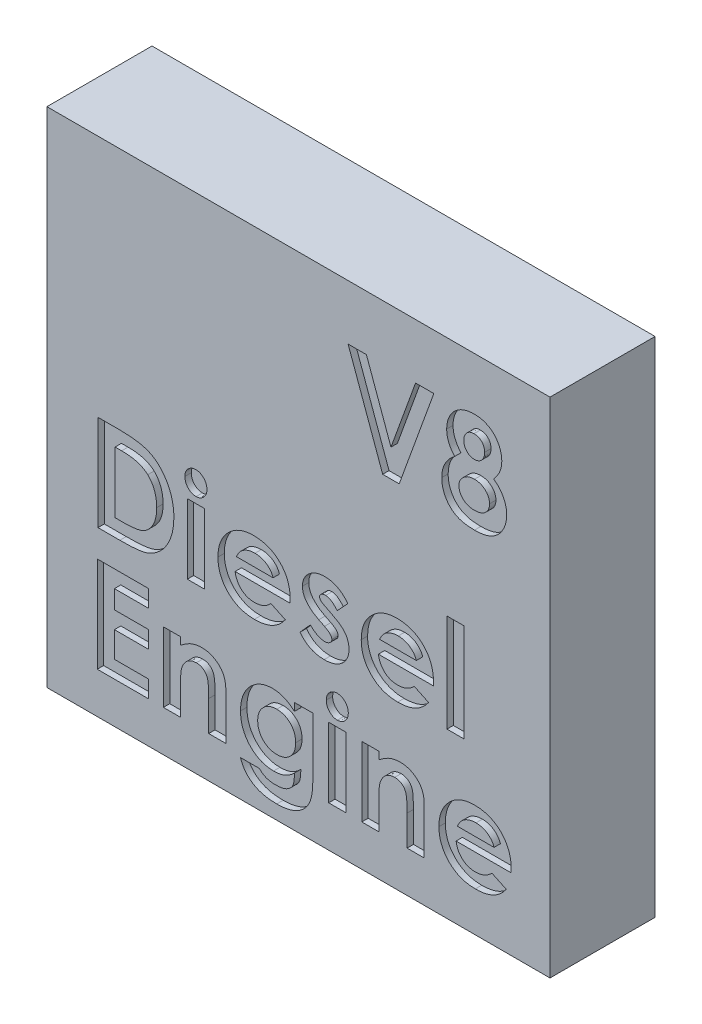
from build123d import *

# Parameters (mm, degrees)
SKETCH_1_W          = 15.8
SKETCH_1_H          = 15.8
EXTRUDE_286_DEPTH   = 3.3
SKETCH_3_W          = 12.8
SKETCH_3_H          = 12.8
CUT_EXTRUDE_1_DEPTH = 2
SKETCH_4_R          = 3.25
SKETCH_4_R_2        = 2.5
EXTRUDE_2_DEPTH     = 2
CUT_EXTRUDE1_DEPTH  = 0.2
SKETCH2_W           = 0.538461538
SKETCH2_H           = 2.192307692
CUT_EXTRUDE2_DEPTH  = 0.2
SKETCH3_W           = 0.538461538
SKETCH3_H           = 2.192307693
SKETCH3_H_2         = 3.076923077
CUT_EXTRUDE3_DEPTH  = 0.2


with BuildPart() as part:
    # Sketch 1 → Extrude 286 (new body)
    with BuildSketch(Plane(origin=(0.007312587, -0.1312965, 0), x_dir=(1, 0, 0), z_dir=(0, 0, 1))):
        with Locations((-0.684916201, 0.099581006)):
            Rectangle(SKETCH_1_W, SKETCH_1_H)
    extrude(amount=-EXTRUDE_286_DEPTH)

    # Sketch 3 → Cut-Extrude 1 (cut)
    with BuildSketch(Plane(origin=(0, 0, -3.3), x_dir=(-1, 0, 0), z_dir=(0, 0, -1))):
        with Locations((0.677603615, -0.031715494)):
            Rectangle(SKETCH_3_W, SKETCH_3_H)
    extrude(amount=-CUT_EXTRUDE_1_DEPTH, mode=Mode.SUBTRACT)

    # Sketch 4 → Extrude 2 (add)
    with BuildSketch(Plane(origin=(0, 0, -1.3), x_dir=(-1, 0, 0), z_dir=(0, 0, -1))):
        with Locations((0.577603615, 0.068284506)):
            Circle(SKETCH_4_R)
        with Locations((0.577603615, 0.068284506)):
            Circle(SKETCH_4_R_2, mode=Mode.SUBTRACT)
    extrude(amount=EXTRUDE_2_DEPTH)

    # Sketch1 → Cut-Extrude1 (cut)
    # profile 1 of 2: a face of its own
    with BuildSketch(Plane.XY):
        Polygon((0.881378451, 6.140898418), (1.456498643, 6.140898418), (2.227532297, 4.009888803), (3.000368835, 6.140898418), (3.573686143, 6.140898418), (2.485945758, 3.140898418), (1.967315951, 3.140898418), align=None)
    # profile 2 of 2: a face of its own
    with BuildSketch(Plane.XY):
        with BuildLine():
            add(Edge.make_bspline(
                [(5.451089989, 4.756283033), (5.482548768, 4.733804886), (5.544818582, 4.689311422), (5.627054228, 4.609599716), (5.697887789, 4.520680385), (5.756575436, 4.42309884), (5.803594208, 4.319253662), (5.837252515, 4.210254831), (5.858631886, 4.097063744), (5.860967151, 4.020000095), (5.862147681, 3.981042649)],
                knots=[0, 0, 0, 0, 1.013736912, 2.006600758, 2.994453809, 3.989973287, 4.987781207, 5.978959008, 6.978317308, 8, 8, 8, 8], degree=3))
            add(Edge.make_bspline(
                [(5.862147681, 3.981042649), (5.860723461, 3.938858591), (5.857898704, 3.855191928), (5.832924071, 3.732494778), (5.792828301, 3.614618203), (5.738029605, 3.502863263), (5.66932212, 3.400702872), (5.589237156, 3.310261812), (5.49767376, 3.233902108), (5.412425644, 3.182092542), (5.339049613, 3.147676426), (5.279835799, 3.125650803), (5.217309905, 3.106260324), (5.151025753, 3.090768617), (5.080995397, 3.078674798), (5.007318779, 3.070688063), (4.929947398, 3.064882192), (4.877183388, 3.064282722), (4.850128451, 3.063975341)],
                knots=[0, 0, 0, 0, 1.313679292, 2.605514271, 3.884962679, 5.186178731, 6.472827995, 7.711026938, 8.938935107, 10.174644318, 10.808706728, 11.462743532, 12.142127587, 12.847854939, 13.582806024, 14.355735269, 15.156897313, 16, 16, 16, 16], degree=3))
            add(Edge.make_bspline(
                [(4.850128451, 3.063975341), (4.821277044, 3.064366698), (4.764935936, 3.065130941), (4.682690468, 3.069751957), (4.605108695, 3.07827132), (4.532027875, 3.089486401), (4.463518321, 3.104327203), (4.399578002, 3.123144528), (4.340052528, 3.144570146), (4.267190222, 3.177192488), (4.183921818, 3.228139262), (4.093923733, 3.302749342), (4.014928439, 3.391612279), (3.946249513, 3.492233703), (3.892114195, 3.603994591), (3.851857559, 3.723387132), (3.828017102, 3.850087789), (3.825146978, 3.93687151), (3.823686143, 3.981042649)],
                knots=[0, 0, 0, 0, 0.886964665, 1.7320671, 2.531131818, 3.285397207, 4.004107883, 4.684213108, 5.332925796, 5.947568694, 7.135706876, 8.320776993, 9.52873045, 10.778999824, 12.05415135, 13.333578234, 14.642845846, 16, 16, 16, 16], degree=3))
            add(Edge.make_bspline(
                [(3.823686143, 3.981042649), (3.825021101, 4.019574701), (3.827644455, 4.09529485), (3.846435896, 4.206248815), (3.878657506, 4.311446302), (3.92287057, 4.411619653), (3.979882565, 4.506780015), (4.050030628, 4.596227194), (4.132425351, 4.680768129), (4.194906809, 4.730693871), (4.226931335, 4.756283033)],
                knots=[0, 0, 0, 0, 1.01821053, 2.000906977, 2.963938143, 3.919209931, 4.888045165, 5.887808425, 6.917407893, 8, 8, 8, 8], degree=3))
            add(Edge.make_bspline(
                [(4.226931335, 4.756283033), (4.207077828, 4.77918115), (4.167992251, 4.824260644), (4.11741513, 4.896812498), (4.074806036, 4.971613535), (4.038628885, 5.048056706), (4.011885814, 5.127458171), (3.991661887, 5.208569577), (3.980223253, 5.292217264), (3.97843536, 5.34859829), (3.977532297, 5.377076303)],
                knots=[0, 0, 0, 0, 1.061529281, 2.089831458, 3.092927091, 4.075998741, 5.048384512, 6.024008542, 7.00192825, 8, 8, 8, 8], degree=3))
            add(Edge.make_bspline(
                [(3.977532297, 5.377076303), (3.978729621, 5.415627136), (3.981091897, 5.491686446), (4.002014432, 5.602903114), (4.036750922, 5.708581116), (4.08400696, 5.808411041), (4.144014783, 5.900217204), (4.215317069, 5.982546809), (4.298916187, 6.052384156), (4.391703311, 6.112307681), (4.494143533, 6.159970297), (4.605264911, 6.193321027), (4.723725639, 6.214433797), (4.805365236, 6.216675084), (4.847123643, 6.217821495)],
                knots=[0, 0, 0, 0, 1.022455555, 2.017265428, 2.990720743, 3.968117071, 4.939886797, 5.893155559, 6.847550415, 7.820889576, 8.817530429, 9.83499769, 10.892607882, 12, 12, 12, 12], degree=3))
            add(Edge.make_bspline(
                [(4.847123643, 6.217821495), (4.888280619, 6.216673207), (4.968528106, 6.214434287), (5.084907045, 6.193461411), (5.193627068, 6.159367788), (5.293789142, 6.110698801), (5.385616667, 6.050659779), (5.467794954, 5.978390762), (5.538873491, 5.894010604), (5.599379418, 5.799829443), (5.647593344, 5.698362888), (5.683237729, 5.59195414), (5.703854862, 5.481439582), (5.706813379, 5.406405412), (5.708301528, 5.368662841)],
                knots=[0, 0, 0, 0, 1.094655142, 2.134348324, 3.136019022, 4.118575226, 5.088726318, 6.048298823, 7.020513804, 8.015920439, 9.020015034, 10.003048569, 10.995523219, 12, 12, 12, 12], degree=3))
            add(Edge.make_bspline(
                [(5.708301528, 5.368662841), (5.707584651, 5.341988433), (5.706177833, 5.289641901), (5.695776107, 5.212520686), (5.678260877, 5.138522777), (5.653840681, 5.065859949), (5.619888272, 4.992557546), (5.573942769, 4.917210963), (5.518056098, 4.836689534), (5.474165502, 4.783989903), (5.451089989, 4.756283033)],
                knots=[0, 0, 0, 0, 0.940746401, 1.846144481, 2.739104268, 3.619506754, 4.545839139, 5.581956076, 6.728711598, 8, 8, 8, 8], degree=3))
        make_face()
        with BuildLine():
            add(Edge.make_bspline(
                [(4.833902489, 5.679359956), (4.811732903, 5.678291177), (4.76860816, 5.676212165), (4.707074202, 5.657446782), (4.651753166, 5.626754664), (4.603907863, 5.584516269), (4.564672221, 5.533266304), (4.53583618, 5.474343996), (4.518736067, 5.408476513), (4.516925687, 5.362354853), (4.515993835, 5.338614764)],
                knots=[0, 0, 0, 0, 1.018099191, 1.980427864, 2.929421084, 3.909248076, 4.895556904, 5.880788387, 6.909183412, 8, 8, 8, 8], degree=3))
            add(Edge.make_bspline(
                [(4.515993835, 5.338614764), (4.517144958, 5.31467193), (4.519392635, 5.267921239), (4.537068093, 5.200788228), (4.567196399, 5.139946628), (4.60856236, 5.086667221), (4.658828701, 5.043150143), (4.715111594, 5.00991422), (4.778035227, 4.990940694), (4.821761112, 4.988367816), (4.844118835, 4.987052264)],
                knots=[0, 0, 0, 0, 1.07118507, 2.091592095, 3.082435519, 4.092579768, 5.090825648, 6.043203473, 6.999459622, 8, 8, 8, 8], degree=3))
            add(Edge.make_bspline(
                [(4.844118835, 4.987052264), (4.866899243, 4.988071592), (4.91127975, 4.990057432), (4.974360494, 5.009523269), (5.031188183, 5.040654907), (5.079852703, 5.084668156), (5.120161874, 5.137966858), (5.149518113, 5.199871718), (5.166414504, 5.269219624), (5.168670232, 5.317687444), (5.169839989, 5.342821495)],
                knots=[0, 0, 0, 0, 1.008803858, 1.965339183, 2.900766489, 3.864508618, 4.855158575, 5.849593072, 6.884859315, 8, 8, 8, 8], degree=3))
            add(Edge.make_bspline(
                [(5.169839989, 5.342821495), (5.168640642, 5.36654589), (5.166321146, 5.412428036), (5.149689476, 5.478299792), (5.119144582, 5.536302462), (5.079012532, 5.587234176), (5.028697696, 5.628307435), (4.970285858, 5.658512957), (4.904207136, 5.676032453), (4.857844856, 5.678226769), (4.833902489, 5.679359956)],
                knots=[0, 0, 0, 0, 1.065910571, 2.061433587, 3.023559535, 3.990682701, 4.956464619, 5.918590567, 6.925120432, 8, 8, 8, 8], degree=3))
        make_face(mode=Mode.SUBTRACT)
        with BuildLine():
            add(Edge.make_bspline(
                [(4.851330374, 4.448590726), (4.834483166, 4.448310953), (4.801277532, 4.447759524), (4.75246252, 4.44140072), (4.705619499, 4.43192453), (4.660806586, 4.418852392), (4.618250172, 4.40103178), (4.577589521, 4.379548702), (4.538965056, 4.354185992), (4.502949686, 4.325404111), (4.470400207, 4.293813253), (4.441059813, 4.260865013), (4.417078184, 4.225707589), (4.397107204, 4.189509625), (4.381060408, 4.151984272), (4.370452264, 4.112513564), (4.363622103, 4.07162314), (4.362642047, 4.043770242), (4.362147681, 4.029720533)],
                knots=[0, 0, 0, 0, 1.129580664, 2.226389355, 3.296443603, 4.333934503, 5.352185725, 6.386189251, 7.41493955, 8.447544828, 9.47401038, 10.455044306, 11.4018853, 12.322125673, 13.225630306, 14.132028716, 15.057747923, 16, 16, 16, 16], degree=3))
            add(Edge.make_bspline(
                [(4.362147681, 4.029720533), (4.362383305, 4.015068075), (4.362850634, 3.986006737), (4.369908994, 3.943589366), (4.380071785, 3.902680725), (4.394345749, 3.863663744), (4.413434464, 3.826561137), (4.436226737, 3.791012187), (4.463517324, 3.75726617), (4.494566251, 3.72550402), (4.529325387, 3.696848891), (4.566788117, 3.671603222), (4.606459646, 3.649345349), (4.649530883, 3.633314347), (4.69440673, 3.618641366), (4.742289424, 3.609739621), (4.792655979, 3.60318947), (4.827067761, 3.602692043), (4.844719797, 3.60243688)],
                knots=[0, 0, 0, 0, 0.973817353, 1.931446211, 2.852767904, 3.776304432, 4.688323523, 5.623710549, 6.581246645, 7.570897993, 8.57436511, 9.572506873, 10.574556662, 11.591826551, 12.624694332, 13.712108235, 14.826391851, 16, 16, 16, 16], degree=3))
            add(Edge.make_bspline(
                [(4.844719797, 3.60243688), (4.862563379, 3.602760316), (4.89733487, 3.60339059), (4.948163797, 3.608961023), (4.996238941, 3.61779968), (5.041502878, 3.630441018), (5.084126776, 3.646635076), (5.123538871, 3.667246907), (5.160639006, 3.690605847), (5.194234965, 3.717896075), (5.224910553, 3.747636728), (5.251341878, 3.780229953), (5.273816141, 3.814627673), (5.291944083, 3.851201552), (5.306571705, 3.889778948), (5.316605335, 3.930744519), (5.322831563, 3.973637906), (5.323398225, 4.002855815), (5.323686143, 4.017701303)],
                knots=[0, 0, 0, 0, 1.200705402, 2.339794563, 3.437264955, 4.487414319, 5.499029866, 6.500076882, 7.476298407, 8.444948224, 9.407950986, 10.347155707, 11.263432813, 12.167927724, 13.089546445, 14.03463663, 15.00140776, 16, 16, 16, 16], degree=3))
            add(Edge.make_bspline(
                [(5.323686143, 4.017701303), (5.323136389, 4.032740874), (5.322061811, 4.062138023), (5.316181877, 4.105549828), (5.305151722, 4.146704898), (5.290721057, 4.186557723), (5.271524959, 4.224283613), (5.247693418, 4.25980295), (5.220567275, 4.293995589), (5.188862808, 4.325339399), (5.154198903, 4.353998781), (5.117304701, 4.379531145), (5.078293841, 4.401154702), (5.037059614, 4.418830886), (4.993451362, 4.431931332), (4.947801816, 4.441400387), (4.900185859, 4.447760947), (4.867777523, 4.448311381), (4.851330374, 4.448590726)],
                knots=[0, 0, 0, 0, 1.011708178, 1.977538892, 2.938094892, 3.871441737, 4.823268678, 5.775953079, 6.743660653, 7.753304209, 8.767430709, 9.76505158, 10.765940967, 11.761741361, 12.775867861, 13.822051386, 14.89469657, 16, 16, 16, 16], degree=3))
        make_face(mode=Mode.SUBTRACT)
    extrude(amount=-CUT_EXTRUDE1_DEPTH, mode=Mode.SUBTRACT)

    # Sketch2 → Cut-Extrude2 (cut)
    # profile 1 of 7: a face of its own
    with BuildSketch(Plane.XY):
        Polygon((-6.99675732, -3.642575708), (-5.381372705, -3.642575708), (-5.381372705, -4.181037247), (-6.458295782, -4.181037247), (-6.458295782, -4.757960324), (-5.381372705, -4.757960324), (-5.381372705, -5.296421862), (-6.458295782, -5.296421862), (-6.458295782, -6.10411417), (-5.381372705, -6.10411417), (-5.381372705, -6.642575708), (-6.99675732, -6.642575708), align=None)
    # profile 2 of 7: a face of its own
    with BuildSketch(Plane.XY):
        with BuildLine():
            Line((-4.919834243, -4.450268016), (-4.381372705, -4.450268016))
            Line((-4.381372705, -4.450268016), (-4.381372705, -4.68223917))
            add(Edge.make_bspline(
                [(-4.381372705, -4.68223917), (-4.350653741, -4.658345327), (-4.291943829, -4.612679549), (-4.202694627, -4.554455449), (-4.11845443, -4.506801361), (-4.037345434, -4.470553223), (-3.957841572, -4.444474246), (-3.87865522, -4.425738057), (-3.798607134, -4.413740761), (-3.74479539, -4.412450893), (-3.717911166, -4.411806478)],
                knots=[0, 0, 0, 0, 1.276643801, 2.439914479, 3.493451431, 4.44993799, 5.350072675, 6.235028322, 7.118224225, 8, 8, 8, 8], degree=3))
            add(Edge.make_bspline(
                [(-3.717911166, -4.411806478), (-3.69064074, -4.412542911), (-3.637106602, -4.41398859), (-3.558280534, -4.424099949), (-3.482969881, -4.442515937), (-3.410327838, -4.466967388), (-3.341093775, -4.499241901), (-3.274419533, -4.537562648), (-3.211737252, -4.584239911), (-3.173134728, -4.619787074), (-3.153608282, -4.637768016)],
                knots=[0, 0, 0, 0, 1.048836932, 2.058954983, 3.049370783, 4.026390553, 5.001981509, 5.982488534, 6.97947532, 8, 8, 8, 8], degree=3))
            add(Edge.make_bspline(
                [(-3.153608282, -4.637768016), (-3.137947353, -4.654431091), (-3.106510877, -4.687879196), (-3.066952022, -4.745117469), (-3.033006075, -4.807517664), (-3.005192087, -4.875799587), (-2.984638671, -4.950338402), (-2.968826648, -5.030233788), (-2.959954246, -5.115933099), (-2.958858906, -5.174807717), (-2.958295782, -5.205075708)],
                knots=[0, 0, 0, 0, 0.889584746, 1.785680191, 2.700364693, 3.65222533, 4.649950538, 5.707241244, 6.821271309, 8, 8, 8, 8], degree=3))
            Line((-2.958295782, -5.205075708), (-2.958295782, -6.642575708))
            Line((-2.958295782, -6.642575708), (-3.49675732, -6.642575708))
            Line((-3.49675732, -6.642575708), (-3.49675732, -5.690652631))
            add(Edge.make_bspline(
                [(-3.49675732, -5.690652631), (-3.496871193, -5.659602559), (-3.497089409, -5.600100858), (-3.498764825, -5.514944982), (-3.502036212, -5.438038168), (-3.505017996, -5.369240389), (-3.510872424, -5.308795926), (-3.516152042, -5.256322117), (-3.524253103, -5.21229501), (-3.534793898, -5.16493725), (-3.553200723, -5.114232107), (-3.58177642, -5.060805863), (-3.6180287, -5.015419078), (-3.660476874, -4.977753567), (-3.709074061, -4.947956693), (-3.763233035, -4.926992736), (-3.822663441, -4.913927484), (-3.864073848, -4.912531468), (-3.885579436, -4.911806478)],
                knots=[0, 0, 0, 0, 1.49886392, 2.872294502, 4.110984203, 5.214877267, 6.195405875, 7.042225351, 7.75923308, 8.355011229, 9.382752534, 10.352059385, 11.267231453, 12.171456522, 13.078624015, 14.003401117, 14.963110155, 16, 16, 16, 16], degree=3))
            add(Edge.make_bspline(
                [(-3.885579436, -4.911806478), (-3.913548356, -4.913224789), (-3.968261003, -4.915999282), (-4.0473919, -4.93692149), (-4.12007231, -4.972504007), (-4.185708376, -5.021743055), (-4.243674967, -5.082534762), (-4.29141779, -5.155035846), (-4.330576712, -5.237496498), (-4.347415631, -5.297706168), (-4.35613232, -5.328873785)],
                knots=[0, 0, 0, 0, 0.984188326, 1.925263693, 2.85911992, 3.81709677, 4.80007086, 5.801799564, 6.862098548, 8, 8, 8, 8], degree=3))
            add(Edge.make_bspline(
                [(-4.35613232, -5.328873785), (-4.358298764, -5.338662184), (-4.363130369, -5.360492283), (-4.367103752, -5.397371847), (-4.372631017, -5.44112588), (-4.374701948, -5.492546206), (-4.378303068, -5.551389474), (-4.379634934, -5.617733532), (-4.380969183, -5.691448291), (-4.381233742, -5.742935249), (-4.381372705, -5.769979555)],
                knots=[0, 0, 0, 0, 0.543362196, 1.211806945, 2.009705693, 2.934833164, 4.000995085, 5.207458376, 6.533175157, 8, 8, 8, 8], degree=3))
            Line((-4.381372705, -5.769979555), (-4.381372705, -6.642575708))
            Line((-4.381372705, -6.642575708), (-4.919834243, -6.642575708))
            Line((-4.919834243, -6.642575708), (-4.919834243, -4.450268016))
        make_face()
    # profile 3 of 7: a face of its own
    with BuildSketch(Plane.XY):
        with BuildLine():
            Line((-0.804449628, -4.450268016), (-0.227526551, -4.450268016))
            Line((-0.227526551, -4.450268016), (-0.227526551, -6.320460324))
            add(Edge.make_bspline(
                [(-0.227526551, -6.320460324), (-0.228219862, -6.365151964), (-0.229558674, -6.451453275), (-0.239771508, -6.576526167), (-0.256802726, -6.692475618), (-0.281310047, -6.799465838), (-0.312962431, -6.897103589), (-0.351674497, -6.985713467), (-0.396659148, -7.065770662), (-0.433646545, -7.112550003), (-0.451685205, -7.13536417)],
                knots=[0, 0, 0, 0, 1.243822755, 2.401870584, 3.490053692, 4.503076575, 5.453444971, 6.342269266, 7.191528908, 8, 8, 8, 8], degree=3))
            add(Edge.make_bspline(
                [(-0.451685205, -7.13536417), (-0.47758897, -7.163777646), (-0.529265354, -7.220460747), (-0.620373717, -7.291992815), (-0.720186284, -7.353129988), (-0.829721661, -7.403234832), (-0.948849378, -7.441398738), (-1.077263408, -7.468883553), (-1.21504516, -7.48600239), (-1.310207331, -7.487803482), (-1.359137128, -7.488729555)],
                knots=[0, 0, 0, 0, 0.916003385, 1.827369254, 2.751972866, 3.703651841, 4.69362366, 5.730423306, 6.83304546, 8, 8, 8, 8], degree=3))
            add(Edge.make_bspline(
                [(-1.359137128, -7.488729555), (-1.410858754, -7.487928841), (-1.51033276, -7.486388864), (-1.653274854, -7.471324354), (-1.783481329, -7.446536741), (-1.901563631, -7.411639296), (-2.008621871, -7.366611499), (-2.106674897, -7.312620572), (-2.195534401, -7.248069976), (-2.276543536, -7.175504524), (-2.347823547, -7.093330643), (-2.408689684, -7.002300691), (-2.460544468, -6.903251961), (-2.486148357, -6.832420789), (-2.499161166, -6.796421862)],
                knots=[0, 0, 0, 0, 1.29412125, 2.488928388, 3.592140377, 4.607309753, 5.564519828, 6.493640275, 7.402258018, 8.307438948, 9.210158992, 10.116782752, 11.042881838, 12, 12, 12, 12], degree=3))
            Line((-2.499161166, -6.796421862), (-1.900603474, -6.796421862))
            add(Edge.make_bspline(
                [(-1.900603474, -6.796421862), (-1.886771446, -6.811649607), (-1.858931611, -6.842298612), (-1.809690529, -6.881190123), (-1.755218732, -6.91447936), (-1.695076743, -6.94173788), (-1.629013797, -6.962465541), (-1.557479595, -6.978212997), (-1.480153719, -6.987087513), (-1.426867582, -6.988171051), (-1.399401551, -6.988729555)],
                knots=[0, 0, 0, 0, 0.888971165, 1.789239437, 2.70354581, 3.646217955, 4.638595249, 5.694475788, 6.811630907, 8, 8, 8, 8], degree=3))
            add(Edge.make_bspline(
                [(-1.399401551, -6.988729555), (-1.364691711, -6.988081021), (-1.298398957, -6.986842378), (-1.204609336, -6.973299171), (-1.120853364, -6.953066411), (-1.048340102, -6.922616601), (-0.985779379, -6.886042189), (-0.933588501, -6.843556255), (-0.890494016, -6.796759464), (-0.862305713, -6.752735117), (-0.845555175, -6.712797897), (-0.834149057, -6.678312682), (-0.825487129, -6.638562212), (-0.817602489, -6.594290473), (-0.811708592, -6.544927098), (-0.80780381, -6.490576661), (-0.804417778, -6.431478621), (-0.804438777, -6.39037775), (-0.804449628, -6.369138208)],
                knots=[0, 0, 0, 0, 1.656375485, 3.163532, 4.516250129, 5.759907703, 6.905105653, 7.965920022, 8.961443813, 9.932912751, 10.442911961, 11.026787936, 11.664959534, 12.383728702, 13.174001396, 14.037595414, 14.985895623, 16, 16, 16, 16], degree=3))
            add(Edge.make_bspline(
                [(-0.804449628, -6.369138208), (-0.828039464, -6.392274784), (-0.874072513, -6.437423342), (-0.948799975, -6.495023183), (-1.025296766, -6.542599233), (-1.1040025, -6.58042011), (-1.186482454, -6.608123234), (-1.273221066, -6.628019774), (-1.365206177, -6.640143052), (-1.428410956, -6.641753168), (-1.460699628, -6.642575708)],
                knots=[0, 0, 0, 0, 1.082007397, 2.111422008, 3.08419067, 4.02964304, 4.965866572, 5.929243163, 6.942137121, 8, 8, 8, 8], degree=3))
            add(Edge.make_bspline(
                [(-1.460699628, -6.642575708), (-1.496414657, -6.641750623), (-1.566571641, -6.640129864), (-1.669617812, -6.624379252), (-1.768481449, -6.599872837), (-1.863428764, -6.565757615), (-1.953490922, -6.520464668), (-2.039949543, -6.466578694), (-2.121202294, -6.401270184), (-2.198370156, -6.328184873), (-2.268116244, -6.246947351), (-2.329488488, -6.159698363), (-2.381226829, -6.067039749), (-2.42330198, -5.969057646), (-2.456825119, -5.86616338), (-2.479896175, -5.757799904), (-2.493994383, -5.644150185), (-2.495824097, -5.566695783), (-2.49675732, -5.527191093)],
                knots=[0, 0, 0, 0, 1.007560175, 1.979205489, 2.935124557, 3.879618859, 4.820364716, 5.775815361, 6.749909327, 7.75781854, 8.772289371, 9.766897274, 10.764314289, 11.762244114, 12.772609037, 13.814079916, 14.885097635, 16, 16, 16, 16], degree=3))
            add(Edge.make_bspline(
                [(-2.49675732, -5.527191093), (-2.495942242, -5.485073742), (-2.494349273, -5.402760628), (-2.478733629, -5.282531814), (-2.454434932, -5.16834764), (-2.419747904, -5.060446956), (-2.374176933, -4.95929103), (-2.319106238, -4.864558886), (-2.255055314, -4.775167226), (-2.204353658, -4.722136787), (-2.178848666, -4.695460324)],
                knots=[0, 0, 0, 0, 1.104124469, 2.157873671, 3.173961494, 4.162551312, 5.124378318, 6.07778831, 7.033049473, 8, 8, 8, 8], degree=3))
            add(Edge.make_bspline(
                [(-2.178848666, -4.695460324), (-2.154644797, -4.672713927), (-2.106949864, -4.627891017), (-2.028873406, -4.570375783), (-1.948011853, -4.521044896), (-1.863256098, -4.481363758), (-1.775205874, -4.449763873), (-1.683339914, -4.427657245), (-1.588115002, -4.414026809), (-1.523445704, -4.412552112), (-1.490747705, -4.411806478)],
                knots=[0, 0, 0, 0, 1.042068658, 2.053448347, 3.038272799, 4.011764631, 4.986555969, 5.970496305, 6.973845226, 8, 8, 8, 8], degree=3))
            add(Edge.make_bspline(
                [(-1.490747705, -4.411806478), (-1.460064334, -4.412668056), (-1.39926329, -4.414375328), (-1.309182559, -4.426420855), (-1.221955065, -4.447701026), (-1.136625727, -4.476956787), (-1.052290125, -4.514854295), (-0.969021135, -4.564526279), (-0.885130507, -4.623919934), (-0.831898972, -4.670327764), (-0.804449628, -4.694258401)],
                knots=[0, 0, 0, 0, 0.968122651, 1.918396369, 2.861262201, 3.796768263, 4.761417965, 5.77287463, 6.85156174, 8, 8, 8, 8], degree=3))
            Line((-0.804449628, -4.694258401), (-0.804449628, -4.450268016))
        make_face()
        with BuildLine():
            add(Edge.make_bspline(
                [(-1.362141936, -4.911806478), (-1.38319325, -4.912484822), (-1.424637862, -4.913820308), (-1.48554836, -4.921344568), (-1.543352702, -4.93554733), (-1.598755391, -4.953989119), (-1.651082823, -4.978796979), (-1.700436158, -5.009064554), (-1.747400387, -5.044196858), (-1.790481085, -5.084856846), (-1.830413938, -5.128790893), (-1.863942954, -5.177142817), (-1.893823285, -5.227159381), (-1.917059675, -5.280853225), (-1.936274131, -5.336767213), (-1.948017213, -5.396039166), (-1.957400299, -5.457585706), (-1.957993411, -5.499707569), (-1.958295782, -5.521181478)],
                knots=[0, 0, 0, 0, 1.059154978, 2.085203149, 3.079850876, 4.048488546, 5.017545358, 5.985239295, 6.956545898, 7.961752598, 8.960830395, 9.936516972, 10.916356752, 11.886198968, 12.873933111, 13.883774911, 14.921139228, 16, 16, 16, 16], degree=3))
            add(Edge.make_bspline(
                [(-1.958295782, -5.521181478), (-1.957968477, -5.543450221), (-1.957326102, -5.587155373), (-1.948332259, -5.650825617), (-1.935484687, -5.711761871), (-1.916077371, -5.769220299), (-1.891781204, -5.823955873), (-1.862595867, -5.875941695), (-1.8265682, -5.923934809), (-1.786560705, -5.968991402), (-1.742301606, -6.009727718), (-1.694660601, -6.045159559), (-1.644618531, -6.0757586), (-1.591093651, -6.099616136), (-1.535244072, -6.118949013), (-1.476509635, -6.132988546), (-1.415025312, -6.140574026), (-1.373178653, -6.141901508), (-1.35192559, -6.142575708)],
                knots=[0, 0, 0, 0, 1.097915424, 2.154794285, 3.166904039, 4.167166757, 5.140698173, 6.119085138, 7.101657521, 8.095747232, 9.089148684, 10.06378348, 11.021581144, 11.977080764, 12.949256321, 13.934658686, 14.951055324, 16, 16, 16, 16], degree=3))
            add(Edge.make_bspline(
                [(-1.35192559, -6.142575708), (-1.331057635, -6.142248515), (-1.290142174, -6.141606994), (-1.230458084, -6.132607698), (-1.173434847, -6.119595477), (-1.119175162, -6.10098797), (-1.067980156, -6.076701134), (-1.019162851, -6.047718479), (-0.97375876, -6.012646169), (-0.930906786, -5.972994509), (-0.892235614, -5.928902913), (-0.858101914, -5.881130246), (-0.830062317, -5.829667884), (-0.806178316, -5.775330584), (-0.788494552, -5.717351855), (-0.775067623, -5.656307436), (-0.767191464, -5.591901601), (-0.766394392, -5.547845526), (-0.76598809, -5.525388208)],
                knots=[0, 0, 0, 0, 1.047368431, 2.053558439, 3.025081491, 3.983010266, 4.928381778, 5.867249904, 6.829345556, 7.804873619, 8.796055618, 9.770545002, 10.747991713, 11.735078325, 12.747239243, 13.787476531, 14.872179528, 16, 16, 16, 16], degree=3))
            add(Edge.make_bspline(
                [(-0.76598809, -5.525388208), (-0.766382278, -5.503129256), (-0.76715195, -5.459667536), (-0.775139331, -5.396080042), (-0.788449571, -5.335801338), (-0.806378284, -5.278333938), (-0.82974341, -5.224021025), (-0.859043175, -5.173368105), (-0.892548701, -5.125439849), (-0.932000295, -5.08186882), (-0.974523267, -5.041569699), (-1.021403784, -5.007477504), (-1.070297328, -4.97735487), (-1.122854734, -4.953474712), (-1.178423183, -4.934666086), (-1.237091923, -4.921799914), (-1.298561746, -4.912771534), (-1.340673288, -4.912132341), (-1.362141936, -4.911806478)],
                knots=[0, 0, 0, 0, 1.111098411, 2.169475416, 3.193737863, 4.190319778, 5.171520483, 6.139320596, 7.107999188, 8.085777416, 9.069626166, 10.027970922, 10.974971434, 11.932846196, 12.904000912, 13.89897495, 14.928888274, 16, 16, 16, 16], degree=3))
        make_face(mode=Mode.SUBTRACT)
    # profile 4 of 7: a face of its own
    with BuildSketch(Plane.XY):
        with BuildLine():
            add(Edge.make_bspline(
                [(0.540502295, -3.527191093), (0.563709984, -3.52832975), (0.609280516, -3.530565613), (0.674566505, -3.552360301), (0.734485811, -3.586566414), (0.78745614, -3.633498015), (0.831511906, -3.689542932), (0.865172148, -3.752288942), (0.883922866, -3.8218095), (0.886527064, -3.869833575), (0.887858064, -3.894378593)],
                knots=[0, 0, 0, 0, 0.989868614, 1.943702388, 2.910836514, 3.924849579, 4.949916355, 5.946401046, 6.950409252, 8, 8, 8, 8], degree=3))
            add(Edge.make_bspline(
                [(0.887858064, -3.894378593), (0.886574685, -3.918742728), (0.884073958, -3.966217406), (0.864740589, -4.03479419), (0.832431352, -4.097509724), (0.788018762, -4.15272227), (0.735622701, -4.19889801), (0.677012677, -4.233725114), (0.612352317, -4.254307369), (0.567488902, -4.256730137), (0.544709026, -4.257960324)],
                knots=[0, 0, 0, 0, 1.05296456, 2.051751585, 3.055639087, 4.085634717, 5.099016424, 6.062201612, 7.016062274, 8, 8, 8, 8], degree=3))
            add(Edge.make_bspline(
                [(0.544709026, -4.257960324), (0.521298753, -4.256825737), (0.475331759, -4.254597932), (0.409510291, -4.232752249), (0.348791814, -4.198815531), (0.29605127, -4.150925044), (0.251490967, -4.094481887), (0.219301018, -4.030275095), (0.199165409, -3.960279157), (0.19677533, -3.911543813), (0.195550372, -3.886566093)],
                knots=[0, 0, 0, 0, 0.989065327, 1.942068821, 2.907541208, 3.917690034, 4.939857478, 5.938239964, 6.943311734, 8, 8, 8, 8], degree=3))
            add(Edge.make_bspline(
                [(0.195550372, -3.886566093), (0.196883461, -3.862615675), (0.199502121, -3.815568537), (0.218365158, -3.747593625), (0.251253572, -3.685902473), (0.294992, -3.630883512), (0.347497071, -3.584827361), (0.407380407, -3.551660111), (0.472227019, -3.530765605), (0.517508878, -3.5283949), (0.540502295, -3.527191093)],
                knots=[0, 0, 0, 0, 1.038616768, 2.040212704, 3.031499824, 4.052181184, 5.074969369, 6.039807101, 7.004644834, 8, 8, 8, 8], degree=3))
        make_face()
    # profile 5 of 7: a face of its own
    with BuildSketch(Plane.XY):
        with Locations((0.541704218, -5.546421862)):
            Rectangle(SKETCH2_W, SKETCH2_H)
    # profile 6 of 7: a face of its own
    with BuildSketch(Plane.XY):
        with BuildLine():
            Line((1.310934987, -4.450268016), (1.849396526, -4.450268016))
            Line((1.849396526, -4.450268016), (1.849396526, -4.68223917))
            add(Edge.make_bspline(
                [(1.849396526, -4.68223917), (1.88011549, -4.658345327), (1.938825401, -4.612679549), (2.028074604, -4.554455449), (2.1123148, -4.506801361), (2.193423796, -4.470553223), (2.272927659, -4.444474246), (2.352114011, -4.425738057), (2.432162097, -4.413740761), (2.485973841, -4.412450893), (2.512858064, -4.411806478)],
                knots=[0, 0, 0, 0, 1.276643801, 2.439914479, 3.493451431, 4.44993799, 5.350072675, 6.235028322, 7.118224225, 8, 8, 8, 8], degree=3))
            add(Edge.make_bspline(
                [(2.512858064, -4.411806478), (2.540128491, -4.412542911), (2.593662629, -4.41398859), (2.672488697, -4.424099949), (2.747799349, -4.442515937), (2.820441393, -4.466967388), (2.889675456, -4.499241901), (2.956349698, -4.537562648), (3.019031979, -4.584239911), (3.057634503, -4.619787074), (3.077160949, -4.637768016)],
                knots=[0, 0, 0, 0, 1.048836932, 2.058954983, 3.049370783, 4.026390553, 5.001981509, 5.982488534, 6.97947532, 8, 8, 8, 8], degree=3))
            add(Edge.make_bspline(
                [(3.077160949, -4.637768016), (3.092821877, -4.654431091), (3.124258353, -4.687879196), (3.163817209, -4.745117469), (3.197763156, -4.807517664), (3.225577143, -4.875799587), (3.246130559, -4.950338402), (3.261942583, -5.030233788), (3.270814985, -5.115933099), (3.271910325, -5.174807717), (3.272473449, -5.205075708)],
                knots=[0, 0, 0, 0, 0.889584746, 1.785680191, 2.700364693, 3.65222533, 4.649950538, 5.707241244, 6.821271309, 8, 8, 8, 8], degree=3))
            Line((3.272473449, -5.205075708), (3.272473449, -6.642575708))
            Line((3.272473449, -6.642575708), (2.73401191, -6.642575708))
            Line((2.73401191, -6.642575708), (2.73401191, -5.690652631))
            add(Edge.make_bspline(
                [(2.73401191, -5.690652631), (2.733898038, -5.659602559), (2.733679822, -5.600100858), (2.732004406, -5.514944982), (2.728733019, -5.438038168), (2.725751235, -5.369240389), (2.719896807, -5.308795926), (2.714617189, -5.256322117), (2.706516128, -5.21229501), (2.695975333, -5.16493725), (2.677568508, -5.114232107), (2.64899281, -5.060805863), (2.612740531, -5.015419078), (2.570292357, -4.977753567), (2.52169517, -4.947956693), (2.467536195, -4.926992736), (2.40810579, -4.913927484), (2.366695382, -4.912531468), (2.345189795, -4.911806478)],
                knots=[0, 0, 0, 0, 1.49886392, 2.872294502, 4.110984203, 5.214877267, 6.195405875, 7.042225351, 7.75923308, 8.355011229, 9.382752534, 10.352059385, 11.267231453, 12.171456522, 13.078624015, 14.003401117, 14.963110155, 16, 16, 16, 16], degree=3))
            add(Edge.make_bspline(
                [(2.345189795, -4.911806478), (2.317220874, -4.913224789), (2.262508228, -4.915999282), (2.183377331, -4.93692149), (2.11069692, -4.972504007), (2.045060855, -5.021743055), (1.987094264, -5.082534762), (1.939351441, -5.155035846), (1.900192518, -5.237496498), (1.8833536, -5.297706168), (1.87463691, -5.328873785)],
                knots=[0, 0, 0, 0, 0.984188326, 1.925263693, 2.85911992, 3.81709677, 4.80007086, 5.801799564, 6.862098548, 8, 8, 8, 8], degree=3))
            add(Edge.make_bspline(
                [(1.87463691, -5.328873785), (1.872470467, -5.338662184), (1.867638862, -5.360492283), (1.863665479, -5.397371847), (1.858138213, -5.44112588), (1.856067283, -5.492546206), (1.852466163, -5.551389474), (1.851134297, -5.617733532), (1.849800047, -5.691448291), (1.849535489, -5.742935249), (1.849396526, -5.769979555)],
                knots=[0, 0, 0, 0, 0.543362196, 1.211806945, 2.009705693, 2.934833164, 4.000995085, 5.207458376, 6.533175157, 8, 8, 8, 8], degree=3))
            Line((1.849396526, -5.769979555), (1.849396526, -6.642575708))
            Line((1.849396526, -6.642575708), (1.310934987, -6.642575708))
            Line((1.310934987, -6.642575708), (1.310934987, -4.450268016))
        make_face()
    # profile 7 of 7: a face of its own
    with BuildSketch(Plane.XY):
        with BuildLine():
            Line((6.001439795, -5.681037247), (4.272473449, -5.681037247))
            add(Edge.make_bspline(
                [(4.272473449, -5.681037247), (4.275998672, -5.701126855), (4.282926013, -5.74060452), (4.29796898, -5.797949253), (4.317166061, -5.851989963), (4.340172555, -5.902798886), (4.366600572, -5.950644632), (4.397426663, -5.995302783), (4.432259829, -6.036733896), (4.470898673, -6.074757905), (4.512699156, -6.108828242), (4.557458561, -6.138676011), (4.605223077, -6.163149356), (4.655445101, -6.183777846), (4.708499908, -6.2001177), (4.764465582, -6.211386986), (4.823193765, -6.218043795), (4.863201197, -6.219006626), (4.883651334, -6.219498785)],
                knots=[0, 0, 0, 0, 1.091296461, 2.144483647, 3.168565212, 4.157007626, 5.126487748, 6.090021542, 7.05641414, 8.019231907, 8.98705074, 9.938580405, 10.892824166, 11.854447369, 12.841318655, 13.858982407, 14.905600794, 16, 16, 16, 16], degree=3))
            add(Edge.make_bspline(
                [(4.883651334, -6.219498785), (4.908336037, -6.218847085), (4.956947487, -6.217563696), (5.028163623, -6.20618194), (5.09704, -6.188990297), (5.162924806, -6.163424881), (5.226581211, -6.131600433), (5.286961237, -6.091951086), (5.345110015, -6.045635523), (5.380587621, -6.009935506), (5.398675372, -5.991734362)],
                knots=[0, 0, 0, 0, 1.021034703, 2.010718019, 2.977989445, 3.954245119, 4.929443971, 5.918328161, 6.938689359, 8, 8, 8, 8], degree=3))
            Line((5.398675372, -5.991734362), (5.849396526, -6.206277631))
            add(Edge.make_bspline(
                [(5.849396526, -6.206277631), (5.835205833, -6.225886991), (5.807087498, -6.264742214), (5.761185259, -6.319421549), (5.71328335, -6.370439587), (5.663346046, -6.417460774), (5.611310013, -6.460351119), (5.557320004, -6.499633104), (5.500586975, -6.534252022), (5.442245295, -6.565882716), (5.381088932, -6.592999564), (5.317287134, -6.616123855), (5.251110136, -6.637028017), (5.181722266, -6.652955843), (5.109701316, -6.66556418), (5.034874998, -6.67451777), (4.957253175, -6.680047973), (4.904494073, -6.680703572), (4.877641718, -6.681037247)],
                knots=[0, 0, 0, 0, 1.028154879, 2.037251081, 3.030720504, 4.000128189, 4.949298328, 5.894184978, 6.834267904, 7.770992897, 8.712077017, 9.673380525, 10.653304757, 11.658697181, 12.695551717, 13.758623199, 14.859225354, 16, 16, 16, 16], degree=3))
            add(Edge.make_bspline(
                [(4.877641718, -6.681037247), (4.836329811, -6.680195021), (4.755422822, -6.678545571), (4.637081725, -6.663236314), (4.524690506, -6.637851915), (4.417931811, -6.603345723), (4.317267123, -6.557786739), (4.222646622, -6.502064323), (4.133124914, -6.437246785), (4.051437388, -6.361973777), (3.977017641, -6.280043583), (3.911651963, -6.192056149), (3.856954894, -6.09862621), (3.812036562, -6.000372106), (3.777124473, -5.897042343), (3.751954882, -5.788591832), (3.736525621, -5.67507237), (3.734859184, -5.597752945), (3.73401191, -5.558441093)],
                knots=[0, 0, 0, 0, 1.103565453, 2.161269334, 3.182010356, 4.179077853, 5.15417608, 6.128274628, 7.109042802, 8.101804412, 9.090965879, 10.063106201, 11.02526161, 11.978650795, 12.945248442, 13.93468508, 14.949922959, 16, 16, 16, 16], degree=3))
            add(Edge.make_bspline(
                [(3.73401191, -5.558441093), (3.734867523, -5.518130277), (3.736550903, -5.438820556), (3.751822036, -5.322679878), (3.777194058, -5.211865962), (3.812208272, -5.106226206), (3.856445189, -5.005430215), (3.911838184, -4.910359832), (3.976985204, -4.820684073), (4.051136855, -4.736822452), (4.133170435, -4.661128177), (4.220338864, -4.593669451), (4.313621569, -4.537458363), (4.411963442, -4.492039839), (4.514735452, -4.455138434), (4.623125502, -4.430583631), (4.736308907, -4.414096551), (4.81367859, -4.412578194), (4.853002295, -4.411806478)],
                knots=[0, 0, 0, 0, 1.079208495, 2.12329425, 3.130605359, 4.119693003, 5.099659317, 6.073216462, 7.060498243, 8.06384408, 9.066070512, 10.045757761, 11.010926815, 11.975797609, 12.942977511, 13.929384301, 14.947594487, 16, 16, 16, 16], degree=3))
            add(Edge.make_bspline(
                [(4.853002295, -4.411806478), (4.894512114, -4.41266177), (4.976012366, -4.414341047), (5.095177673, -4.429525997), (5.208315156, -4.455065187), (5.315906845, -4.489273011), (5.41657875, -4.535982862), (5.512542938, -4.590334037), (5.601497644, -4.656552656), (5.684391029, -4.731457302), (5.759219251, -4.814561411), (5.824627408, -4.904837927), (5.880281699, -5.001405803), (5.925390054, -5.104656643), (5.960266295, -5.214280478), (5.985459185, -5.330134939), (6.000770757, -5.452660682), (6.002406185, -5.53656108), (6.00324268, -5.579474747)],
                knots=[0, 0, 0, 0, 1.080001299, 2.120471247, 3.119684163, 4.095710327, 5.052285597, 6.002875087, 6.961153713, 7.931888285, 8.906493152, 9.865905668, 10.82813294, 11.801621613, 12.7925306, 13.817193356, 14.883530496, 16, 16, 16, 16], degree=3))
            Line((6.00324268, -5.579474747), (6.001439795, -5.681037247))
        make_face()
        with BuildLine():
            add(Edge.make_bspline(
                [(5.464781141, -5.257960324), (5.454620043, -5.230539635), (5.434417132, -5.176020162), (5.388779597, -5.100796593), (5.328220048, -5.035649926), (5.257784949, -4.977975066), (5.177308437, -4.931162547), (5.089326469, -4.897268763), (4.99495112, -4.876945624), (4.930025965, -4.874562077), (4.896872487, -4.873344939)],
                knots=[0, 0, 0, 0, 0.954238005, 1.897273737, 2.851915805, 3.847685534, 4.862635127, 5.880135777, 6.917509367, 8, 8, 8, 8], degree=3))
            add(Edge.make_bspline(
                [(4.896872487, -4.873344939), (4.860663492, -4.874514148), (4.789882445, -4.876799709), (4.687785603, -4.901107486), (4.591480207, -4.937386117), (4.534704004, -4.974790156), (4.506247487, -4.993537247)],
                knots=[0, 0, 0, 0, 1.044195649, 2.041185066, 3.018232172, 4, 4, 4, 4], degree=3))
            add(Edge.make_bspline(
                [(4.506247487, -4.993537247), (4.488492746, -5.007815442), (4.450640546, -5.038255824), (4.401481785, -5.098981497), (4.353059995, -5.172506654), (4.325529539, -5.228354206), (4.310934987, -5.257960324)],
                knots=[0, 0, 0, 0, 0.82159062, 1.751589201, 2.808063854, 4, 4, 4, 4], degree=3))
            Line((4.310934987, -5.257960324), (5.464781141, -5.257960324))
        make_face(mode=Mode.SUBTRACT)
    extrude(amount=-CUT_EXTRUDE2_DEPTH, mode=Mode.SUBTRACT)

    # Sketch3 → Cut-Extrude3 (cut)
    # profile 1 of 7: a face of its own
    with BuildSketch(Plane.XY):
        with BuildLine():
            Line((-6.975535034, 0.219880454), (-6.297049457, 0.219880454))
            add(Edge.make_bspline(
                [(-6.297049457, 0.219880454), (-6.244153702, 0.219510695), (-6.14190561, 0.218795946), (-5.993768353, 0.210742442), (-5.856019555, 0.198356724), (-5.72857042, 0.181317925), (-5.61168224, 0.158770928), (-5.505505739, 0.130490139), (-5.409684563, 0.097844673), (-5.323168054, 0.059430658), (-5.244186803, 0.014643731), (-5.169191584, -0.03524531), (-5.098329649, -0.092064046), (-5.030606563, -0.15471633), (-4.966896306, -0.224348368), (-4.906137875, -0.299806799), (-4.849818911, -0.382185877), (-4.796237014, -0.469510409), (-4.747779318, -0.562150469), (-4.705512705, -0.659317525), (-4.670105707, -0.76038627), (-4.641335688, -0.865464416), (-4.618402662, -0.974203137), (-4.602356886, -1.086821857), (-4.592437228, -1.20321631), (-4.591430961, -1.282102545), (-4.590919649, -1.322186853)],
                knots=[0, 0, 0, 0, 1.44355588, 2.790409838, 4.047694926, 5.217575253, 6.298404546, 7.294384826, 8.214239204, 9.058592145, 9.873746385, 10.689560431, 11.514393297, 12.350027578, 13.205127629, 14.088021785, 14.991911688, 15.926770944, 16.882954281, 17.842803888, 18.816321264, 19.80318086, 20.814351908, 21.847355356, 22.906180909, 24, 24, 24, 24], degree=3))
            add(Edge.make_bspline(
                [(-4.590919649, -1.322186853), (-4.59225854, -1.378748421), (-4.594894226, -1.490093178), (-4.617095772, -1.653490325), (-4.653003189, -1.810122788), (-4.703492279, -1.958765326), (-4.766085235, -2.098094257), (-4.84085953, -2.225652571), (-4.926718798, -2.340755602), (-5.022662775, -2.44283023), (-5.126546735, -2.530564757), (-5.234503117, -2.605702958), (-5.347583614, -2.664955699), (-5.447223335, -2.702530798), (-5.533623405, -2.725899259), (-5.609481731, -2.739710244), (-5.695649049, -2.75237575), (-5.792928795, -2.762163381), (-5.900894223, -2.770891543), (-6.019975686, -2.775634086), (-6.14978763, -2.779574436), (-6.2399543, -2.779933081), (-6.286833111, -2.780119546)],
                knots=[0, 0, 0, 0, 1.315458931, 2.589557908, 3.828601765, 5.048913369, 6.235739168, 7.376350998, 8.481830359, 9.569842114, 10.627874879, 11.640079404, 12.624025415, 13.590060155, 14.111227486, 14.704434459, 15.382649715, 16.137166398, 16.978595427, 17.902333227, 18.909396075, 20, 20, 20, 20], degree=3))
            Line((-6.286833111, -2.780119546), (-6.975535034, -2.780119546))
            Line((-6.975535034, -2.780119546), (-6.975535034, 0.219880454))
        make_face()
        with BuildLine():
            Line((-6.437073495, -0.318581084), (-6.437073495, -2.241658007))
            Line((-6.437073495, -2.241658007), (-6.155823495, -2.241658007))
            add(Edge.make_bspline(
                [(-6.155823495, -2.241658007), (-6.122359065, -2.241596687), (-6.057995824, -2.241478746), (-5.965069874, -2.235861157), (-5.879136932, -2.230222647), (-5.800433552, -2.219520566), (-5.728386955, -2.207599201), (-5.663986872, -2.19100899), (-5.605905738, -2.173582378), (-5.554853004, -2.151396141), (-5.508092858, -2.126424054), (-5.464798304, -2.09716636), (-5.423006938, -2.064676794), (-5.383500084, -2.027999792), (-5.346128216, -1.987621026), (-5.311112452, -1.943332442), (-5.277985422, -1.895269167), (-5.247597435, -1.843177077), (-5.219828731, -1.787606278), (-5.195194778, -1.729095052), (-5.174769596, -1.667156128), (-5.157793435, -1.602369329), (-5.145662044, -1.534170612), (-5.135625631, -1.463065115), (-5.130451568, -1.388771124), (-5.12974146, -1.338219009), (-5.129381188, -1.312571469)],
                knots=[0, 0, 0, 0, 1.50275155, 2.890291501, 4.180787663, 5.369391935, 6.45668281, 7.458360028, 8.354766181, 9.177074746, 9.954075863, 10.732690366, 11.5210699, 12.329727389, 13.151100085, 13.990027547, 14.863562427, 15.770965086, 16.696477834, 17.652329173, 18.619756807, 19.62365428, 20.657822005, 21.729286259, 22.847956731, 24, 24, 24, 24], degree=3))
            add(Edge.make_bspline(
                [(-5.129381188, -1.312571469), (-5.130098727, -1.273269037), (-5.131497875, -1.196632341), (-5.144990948, -1.08500932), (-5.166955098, -0.979899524), (-5.198295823, -0.881693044), (-5.237801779, -0.790113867), (-5.287252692, -0.705937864), (-5.344520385, -0.627750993), (-5.389806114, -0.581884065), (-5.412434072, -0.5589657)],
                knots=[0, 0, 0, 0, 1.13821349, 2.219428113, 3.251817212, 4.244760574, 5.201143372, 6.134805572, 7.068016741, 8, 8, 8, 8], degree=3))
            add(Edge.make_bspline(
                [(-5.412434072, -0.5589657), (-5.434747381, -0.539436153), (-5.480319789, -0.499549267), (-5.560329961, -0.451754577), (-5.648497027, -0.409762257), (-5.746837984, -0.37646703), (-5.854402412, -0.350135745), (-5.971830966, -0.331975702), (-6.09849479, -0.320306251), (-6.186244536, -0.31916846), (-6.231544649, -0.318581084)],
                knots=[0, 0, 0, 0, 0.813307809, 1.661089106, 2.549956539, 3.493439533, 4.508053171, 5.589449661, 6.755572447, 8, 8, 8, 8], degree=3))
            Line((-6.231544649, -0.318581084), (-6.437073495, -0.318581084))
        make_face(mode=Mode.SUBTRACT)
    # profile 2 of 7: a face of its own
    with BuildSketch(Plane.XY):
        with BuildLine():
            add(Edge.make_bspline(
                [(-3.89981388, 0.33526507), (-3.876606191, 0.334126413), (-3.831035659, 0.33189055), (-3.76574967, 0.310095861), (-3.705830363, 0.275889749), (-3.652860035, 0.228958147), (-3.608804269, 0.172913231), (-3.575144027, 0.110167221), (-3.556393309, 0.040646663), (-3.553789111, -0.007377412), (-3.552458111, -0.03192243)],
                knots=[0, 0, 0, 0, 0.989868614, 1.943702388, 2.910836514, 3.924849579, 4.949916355, 5.946401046, 6.950409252, 8, 8, 8, 8], degree=3))
            add(Edge.make_bspline(
                [(-3.552458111, -0.03192243), (-3.55374149, -0.056286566), (-3.556242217, -0.103761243), (-3.575575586, -0.172338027), (-3.607884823, -0.235053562), (-3.652297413, -0.290266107), (-3.704693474, -0.336441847), (-3.763303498, -0.371268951), (-3.827963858, -0.391851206), (-3.872827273, -0.394273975), (-3.895607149, -0.395504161)],
                knots=[0, 0, 0, 0, 1.05296456, 2.051751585, 3.055639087, 4.085634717, 5.099016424, 6.062201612, 7.016062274, 8, 8, 8, 8], degree=3))
            add(Edge.make_bspline(
                [(-3.895607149, -0.395504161), (-3.919017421, -0.394369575), (-3.964984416, -0.392141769), (-4.030805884, -0.370296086), (-4.091524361, -0.336359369), (-4.144264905, -0.288468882), (-4.188825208, -0.232025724), (-4.221015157, -0.167818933), (-4.241150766, -0.097822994), (-4.243540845, -0.049087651), (-4.244765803, -0.02410993)],
                knots=[0, 0, 0, 0, 0.989065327, 1.942068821, 2.907541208, 3.917690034, 4.939857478, 5.938239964, 6.943311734, 8, 8, 8, 8], degree=3))
            add(Edge.make_bspline(
                [(-4.244765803, -0.02410993), (-4.243432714, -0.000159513), (-4.240814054, 0.046887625), (-4.221951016, 0.114862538), (-4.189062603, 0.176553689), (-4.145324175, 0.231572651), (-4.092819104, 0.277628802), (-4.032935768, 0.310796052), (-3.968089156, 0.331690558), (-3.922807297, 0.334061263), (-3.89981388, 0.33526507)],
                knots=[0, 0, 0, 0, 1.038616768, 2.040212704, 3.031499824, 4.052181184, 5.074969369, 6.039807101, 7.004644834, 8, 8, 8, 8], degree=3))
        make_face()
    # profile 3 of 7: a face of its own
    with BuildSketch(Plane.XY):
        with Locations((-3.898611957, -1.6839657)):
            Rectangle(SKETCH3_W, SKETCH3_H)
    # profile 4 of 7: a face of its own
    with BuildSketch(Plane.XY):
        with BuildLine():
            Line((-0.93887638, -1.818581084), (-2.667842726, -1.818581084))
            add(Edge.make_bspline(
                [(-2.667842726, -1.818581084), (-2.664317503, -1.838670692), (-2.657390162, -1.878148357), (-2.642347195, -1.935493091), (-2.623150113, -1.9895338), (-2.60014362, -2.040342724), (-2.573715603, -2.088188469), (-2.542889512, -2.13284662), (-2.508056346, -2.174277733), (-2.469417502, -2.212301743), (-2.427617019, -2.24637208), (-2.382857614, -2.276219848), (-2.335093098, -2.300693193), (-2.284871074, -2.321321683), (-2.231816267, -2.337661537), (-2.175850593, -2.348930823), (-2.11712241, -2.355587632), (-2.077114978, -2.356550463), (-2.056664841, -2.357042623)],
                knots=[0, 0, 0, 0, 1.091296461, 2.144483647, 3.168565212, 4.157007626, 5.126487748, 6.090021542, 7.05641414, 8.019231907, 8.98705074, 9.938580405, 10.892824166, 11.854447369, 12.841318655, 13.858982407, 14.905600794, 16, 16, 16, 16], degree=3))
            add(Edge.make_bspline(
                [(-2.056664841, -2.357042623), (-2.031980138, -2.356390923), (-1.983368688, -2.355107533), (-1.912152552, -2.343725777), (-1.843276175, -2.326534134), (-1.777391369, -2.300968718), (-1.713734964, -2.26914427), (-1.653354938, -2.229494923), (-1.59520616, -2.183179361), (-1.559728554, -2.147479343), (-1.541640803, -2.1292782)],
                knots=[0, 0, 0, 0, 1.021034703, 2.010718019, 2.977989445, 3.954245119, 4.929443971, 5.918328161, 6.938689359, 8, 8, 8, 8], degree=3))
            Line((-1.541640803, -2.1292782), (-1.090919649, -2.343821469))
            add(Edge.make_bspline(
                [(-1.090919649, -2.343821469), (-1.105110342, -2.363430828), (-1.133228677, -2.402286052), (-1.179130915, -2.456965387), (-1.227032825, -2.507983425), (-1.276970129, -2.555004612), (-1.329006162, -2.597894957), (-1.382996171, -2.637176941), (-1.4397292, -2.671795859), (-1.49807088, -2.703426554), (-1.559227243, -2.730543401), (-1.623029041, -2.753667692), (-1.689206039, -2.774571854), (-1.758593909, -2.79049968), (-1.830614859, -2.803108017), (-1.905441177, -2.812061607), (-1.983063, -2.817591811), (-2.035822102, -2.81824741), (-2.062674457, -2.818581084)],
                knots=[0, 0, 0, 0, 1.028154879, 2.037251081, 3.030720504, 4.000128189, 4.949298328, 5.894184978, 6.834267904, 7.770992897, 8.712077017, 9.673380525, 10.653304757, 11.658697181, 12.695551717, 13.758623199, 14.859225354, 16, 16, 16, 16], degree=3))
            add(Edge.make_bspline(
                [(-2.062674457, -2.818581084), (-2.103986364, -2.817738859), (-2.184893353, -2.816089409), (-2.30323445, -2.800780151), (-2.415625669, -2.775395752), (-2.522384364, -2.74088956), (-2.623049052, -2.695330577), (-2.717669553, -2.639608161), (-2.80719126, -2.574790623), (-2.888878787, -2.499517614), (-2.963298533, -2.41758742), (-3.028664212, -2.329599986), (-3.083361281, -2.236170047), (-3.128279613, -2.137915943), (-3.163191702, -2.034586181), (-3.188361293, -1.92613567), (-3.203790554, -1.812616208), (-3.205456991, -1.735296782), (-3.206304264, -1.69598493)],
                knots=[0, 0, 0, 0, 1.103565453, 2.161269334, 3.182010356, 4.179077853, 5.15417608, 6.128274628, 7.109042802, 8.101804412, 9.090965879, 10.063106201, 11.02526161, 11.978650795, 12.945248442, 13.93468508, 14.949922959, 16, 16, 16, 16], degree=3))
            add(Edge.make_bspline(
                [(-3.206304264, -1.69598493), (-3.205448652, -1.655674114), (-3.203765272, -1.576364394), (-3.188494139, -1.460223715), (-3.163122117, -1.349409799), (-3.128107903, -1.243770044), (-3.083870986, -1.142974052), (-3.028477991, -1.047903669), (-2.963330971, -0.958227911), (-2.88917932, -0.87436629), (-2.80714574, -0.798672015), (-2.719977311, -0.731213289), (-2.626694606, -0.6750022), (-2.528352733, -0.629583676), (-2.425580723, -0.592682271), (-2.317190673, -0.568127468), (-2.204007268, -0.551640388), (-2.126637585, -0.550122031), (-2.08731388, -0.549350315)],
                knots=[0, 0, 0, 0, 1.079208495, 2.12329425, 3.130605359, 4.119693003, 5.099659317, 6.073216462, 7.060498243, 8.06384408, 9.066070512, 10.045757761, 11.010926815, 11.975797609, 12.942977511, 13.929384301, 14.947594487, 16, 16, 16, 16], degree=3))
            add(Edge.make_bspline(
                [(-2.08731388, -0.549350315), (-2.045804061, -0.550205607), (-1.964303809, -0.551884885), (-1.845138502, -0.567069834), (-1.732001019, -0.592609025), (-1.62440933, -0.626816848), (-1.523737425, -0.673526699), (-1.427773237, -0.727877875), (-1.338818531, -0.794096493), (-1.255925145, -0.869001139), (-1.181096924, -0.952105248), (-1.115688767, -1.042381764), (-1.060034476, -1.13894964), (-1.014926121, -1.24220048), (-0.98004988, -1.351824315), (-0.95485699, -1.467678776), (-0.939545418, -1.590204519), (-0.93790999, -1.674104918), (-0.937073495, -1.717018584)],
                knots=[0, 0, 0, 0, 1.080001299, 2.120471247, 3.119684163, 4.095710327, 5.052285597, 6.002875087, 6.961153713, 7.931888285, 8.906493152, 9.865905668, 10.82813294, 11.801621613, 12.7925306, 13.817193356, 14.883530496, 16, 16, 16, 16], degree=3))
            Line((-0.937073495, -1.717018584), (-0.93887638, -1.818581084))
        make_face()
        with BuildLine():
            add(Edge.make_bspline(
                [(-1.475535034, -1.395504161), (-1.485696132, -1.368083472), (-1.505899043, -1.313563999), (-1.551536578, -1.23834043), (-1.612096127, -1.173193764), (-1.682531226, -1.115518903), (-1.763007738, -1.068706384), (-1.850989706, -1.0348126), (-1.945365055, -1.014489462), (-2.01029021, -1.012105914), (-2.043443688, -1.010888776)],
                knots=[0, 0, 0, 0, 0.954238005, 1.897273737, 2.851915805, 3.847685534, 4.862635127, 5.880135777, 6.917509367, 8, 8, 8, 8], degree=3))
            add(Edge.make_bspline(
                [(-2.043443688, -1.010888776), (-2.079652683, -1.012057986), (-2.15043373, -1.014343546), (-2.252530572, -1.038651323), (-2.348835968, -1.074929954), (-2.405612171, -1.112333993), (-2.434068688, -1.131081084)],
                knots=[0, 0, 0, 0, 1.044195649, 2.041185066, 3.018232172, 4, 4, 4, 4], degree=3))
            add(Edge.make_bspline(
                [(-2.434068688, -1.131081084), (-2.451823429, -1.145359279), (-2.489675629, -1.175799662), (-2.53883439, -1.236525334), (-2.58725618, -1.310050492), (-2.614786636, -1.365898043), (-2.629381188, -1.395504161)],
                knots=[0, 0, 0, 0, 0.82159062, 1.751589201, 2.808063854, 4, 4, 4, 4], degree=3))
            Line((-2.629381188, -1.395504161), (-1.475535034, -1.395504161))
        make_face(mode=Mode.SUBTRACT)
    # profile 5 of 7: a face of its own
    with BuildSketch(Plane.XY):
        with BuildLine():
            Line((0.870618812, -0.9261532), (0.541291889, -1.280119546))
            add(Edge.make_bspline(
                [(0.541291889, -1.280119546), (0.524847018, -1.261922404), (0.49339421, -1.227118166), (0.445242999, -1.179672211), (0.397808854, -1.140163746), (0.351975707, -1.106974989), (0.306807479, -1.081523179), (0.262679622, -1.063211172), (0.219570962, -1.051586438), (0.19099672, -1.05008166), (0.177109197, -1.049350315)],
                knots=[0, 0, 0, 0, 1.327646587, 2.539285, 3.655602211, 4.666613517, 5.598770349, 6.454635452, 7.248928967, 8, 8, 8, 8], degree=3))
            add(Edge.make_bspline(
                [(0.177109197, -1.049350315), (0.163056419, -1.049778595), (0.13614972, -1.050598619), (0.098178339, -1.057632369), (0.06481794, -1.069809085), (0.036589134, -1.086407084), (0.013909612, -1.106854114), (-0.001969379, -1.130245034), (-0.012632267, -1.155852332), (-0.013534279, -1.174042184), (-0.013996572, -1.183364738)],
                knots=[0, 0, 0, 0, 1.295068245, 2.479652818, 3.543291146, 4.55379989, 5.481948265, 6.332409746, 7.145336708, 8, 8, 8, 8], degree=3))
            add(Edge.make_bspline(
                [(-0.013996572, -1.183364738), (-0.01243028, -1.197492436), (-0.009180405, -1.226805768), (0.013141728, -1.260804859), (0.042675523, -1.285885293), (0.076719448, -1.309224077), (0.122823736, -1.335319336), (0.15779962, -1.353187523), (0.177109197, -1.363052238)],
                knots=[0, 0, 0, 0, 0.916701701, 1.902049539, 2.5493345, 3.440293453, 4.586830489, 6, 6, 6, 6], degree=3))
            Line((0.177109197, -1.363052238), (0.371820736, -1.46160993))
            add(Edge.make_bspline(
                [(0.371820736, -1.46160993), (0.396591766, -1.474187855), (0.444652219, -1.498591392), (0.512220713, -1.537969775), (0.574628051, -1.576138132), (0.63062236, -1.615255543), (0.680546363, -1.654642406), (0.724045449, -1.694688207), (0.762174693, -1.734123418), (0.804694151, -1.786995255), (0.847226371, -1.857416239), (0.882685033, -1.948995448), (0.90529659, -2.047056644), (0.907798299, -2.114928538), (0.909080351, -2.149710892)],
                knots=[0, 0, 0, 0, 1.076693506, 2.088987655, 3.030641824, 3.911722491, 4.735175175, 5.493635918, 6.202154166, 6.859459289, 8.120623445, 9.372284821, 10.653373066, 12, 12, 12, 12], degree=3))
            add(Edge.make_bspline(
                [(0.909080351, -2.149710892), (0.908307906, -2.173176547), (0.906796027, -2.219105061), (0.897238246, -2.286707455), (0.880069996, -2.350987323), (0.857476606, -2.412946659), (0.827043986, -2.47146505), (0.790097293, -2.526826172), (0.747219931, -2.579756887), (0.697278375, -2.62844654), (0.642568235, -2.673824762), (0.581748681, -2.711991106), (0.517508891, -2.745548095), (0.44815175, -2.771753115), (0.374650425, -2.792998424), (0.296374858, -2.807720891), (0.213590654, -2.816986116), (0.156902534, -2.8180404), (0.127830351, -2.818581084)],
                knots=[0, 0, 0, 0, 0.976600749, 1.911466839, 2.833459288, 3.740827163, 4.650527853, 5.570709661, 6.506801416, 7.479409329, 8.468875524, 9.458587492, 10.461481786, 11.480119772, 12.538142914, 13.641687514, 14.790552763, 16, 16, 16, 16], degree=3))
            add(Edge.make_bspline(
                [(0.127830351, -2.818581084), (0.089312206, -2.817354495), (0.013704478, -2.814946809), (-0.096715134, -2.798175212), (-0.200980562, -2.769143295), (-0.299177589, -2.728473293), (-0.391907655, -2.676648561), (-0.477846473, -2.612345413), (-0.55848387, -2.537239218), (-0.605399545, -2.479636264), (-0.629381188, -2.450191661)],
                knots=[0, 0, 0, 0, 1.056901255, 2.07460411, 3.05625841, 4.019970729, 4.984811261, 5.963335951, 6.958928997, 8, 8, 8, 8], degree=3))
            Line((-0.629381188, -2.450191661), (-0.303059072, -2.087811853))
            add(Edge.make_bspline(
                [(-0.303059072, -2.087811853), (-0.287159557, -2.104581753), (-0.255593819, -2.13787549), (-0.20238674, -2.181777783), (-0.146089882, -2.221791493), (-0.086076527, -2.255389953), (-0.026051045, -2.282519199), (0.031538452, -2.302869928), (0.085606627, -2.315658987), (0.12076036, -2.317640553), (0.137445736, -2.318581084)],
                knots=[0, 0, 0, 0, 1.087861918, 2.159761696, 3.243809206, 4.338405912, 5.394481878, 6.343674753, 7.213841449, 8, 8, 8, 8], degree=3))
            add(Edge.make_bspline(
                [(0.137445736, -2.318581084), (0.154122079, -2.318098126), (0.186178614, -2.317169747), (0.231739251, -2.307512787), (0.272121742, -2.291278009), (0.306367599, -2.268768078), (0.334852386, -2.242930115), (0.354923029, -2.213565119), (0.368194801, -2.182427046), (0.369807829, -2.160656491), (0.370618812, -2.149710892)],
                knots=[0, 0, 0, 0, 1.255011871, 2.412479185, 3.488767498, 4.514443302, 5.48617286, 6.365347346, 7.178144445, 8, 8, 8, 8], degree=3))
            add(Edge.make_bspline(
                [(0.370618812, -2.149710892), (0.369895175, -2.139403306), (0.368409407, -2.118239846), (0.356646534, -2.087001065), (0.338178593, -2.056069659), (0.312564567, -2.025358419), (0.279463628, -1.99511653), (0.238994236, -1.965586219), (0.192090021, -1.935192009), (0.157443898, -1.917050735), (0.13924862, -1.907523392)],
                knots=[0, 0, 0, 0, 0.704666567, 1.446816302, 2.258757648, 3.165368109, 4.175243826, 5.322435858, 6.59381024, 8, 8, 8, 8], degree=3))
            Line((0.13924862, -1.907523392), (-0.039236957, -1.817379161))
            add(Edge.make_bspline(
                [(-0.039236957, -1.817379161), (-0.079724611, -1.795668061), (-0.157445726, -1.75399089), (-0.26249562, -1.682523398), (-0.35140519, -1.606444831), (-0.42424689, -1.526163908), (-0.4822873, -1.441905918), (-0.52277438, -1.35259809), (-0.548244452, -1.259087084), (-0.551046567, -1.195143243), (-0.552458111, -1.162932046)],
                knots=[0, 0, 0, 0, 1.255999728, 2.41104856, 3.467751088, 4.449286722, 5.368722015, 6.253902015, 7.120417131, 8, 8, 8, 8], degree=3))
            add(Edge.make_bspline(
                [(-0.552458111, -1.162932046), (-0.551968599, -1.142055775), (-0.551007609, -1.101072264), (-0.540777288, -1.040885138), (-0.525321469, -0.983030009), (-0.503511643, -0.927414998), (-0.475573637, -0.873984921), (-0.441344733, -0.822976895), (-0.400407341, -0.774483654), (-0.35407204, -0.728661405), (-0.302661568, -0.686929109), (-0.247644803, -0.649944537), (-0.189184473, -0.618440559), (-0.126800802, -0.593323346), (-0.06128672, -0.573331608), (0.007790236, -0.559742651), (0.080135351, -0.551100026), (0.129607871, -0.549941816), (0.15487362, -0.549350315)],
                knots=[0, 0, 0, 0, 0.959035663, 1.882742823, 2.798841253, 3.708806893, 4.623422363, 5.566085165, 6.527241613, 7.536786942, 8.55815439, 9.567237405, 10.580975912, 11.605536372, 12.654523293, 13.725718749, 14.838518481, 16, 16, 16, 16], degree=3))
            add(Edge.make_bspline(
                [(0.15487362, -0.549350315), (0.189803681, -0.550500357), (0.25913369, -0.552782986), (0.361381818, -0.571254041), (0.460142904, -0.602299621), (0.555140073, -0.645075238), (0.645151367, -0.698832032), (0.728197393, -0.764110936), (0.804840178, -0.839304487), (0.848474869, -0.896916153), (0.870618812, -0.9261532)],
                knots=[0, 0, 0, 0, 0.996590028, 1.978055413, 2.954661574, 3.945146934, 4.945404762, 5.939399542, 6.954276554, 8, 8, 8, 8], degree=3))
        make_face()
    # profile 6 of 7: a face of its own
    with BuildSketch(Plane.XY):
        with BuildLine():
            Line((3.56112362, -1.818581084), (1.832157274, -1.818581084))
            add(Edge.make_bspline(
                [(1.832157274, -1.818581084), (1.835682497, -1.838670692), (1.842609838, -1.878148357), (1.857652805, -1.935493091), (1.876849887, -1.9895338), (1.89985638, -2.040342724), (1.926284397, -2.088188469), (1.957110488, -2.13284662), (1.991943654, -2.174277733), (2.030582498, -2.212301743), (2.072382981, -2.24637208), (2.117142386, -2.276219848), (2.164906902, -2.300693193), (2.215128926, -2.321321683), (2.268183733, -2.337661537), (2.324149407, -2.348930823), (2.38287759, -2.355587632), (2.422885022, -2.356550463), (2.443335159, -2.357042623)],
                knots=[0, 0, 0, 0, 1.091296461, 2.144483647, 3.168565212, 4.157007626, 5.126487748, 6.090021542, 7.05641414, 8.019231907, 8.98705074, 9.938580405, 10.892824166, 11.854447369, 12.841318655, 13.858982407, 14.905600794, 16, 16, 16, 16], degree=3))
            add(Edge.make_bspline(
                [(2.443335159, -2.357042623), (2.468019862, -2.356390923), (2.516631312, -2.355107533), (2.587847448, -2.343725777), (2.656723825, -2.326534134), (2.722608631, -2.300968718), (2.786265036, -2.26914427), (2.846645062, -2.229494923), (2.90479384, -2.183179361), (2.940271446, -2.147479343), (2.958359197, -2.1292782)],
                knots=[0, 0, 0, 0, 1.021034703, 2.010718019, 2.977989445, 3.954245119, 4.929443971, 5.918328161, 6.938689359, 8, 8, 8, 8], degree=3))
            Line((2.958359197, -2.1292782), (3.409080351, -2.343821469))
            add(Edge.make_bspline(
                [(3.409080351, -2.343821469), (3.394889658, -2.363430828), (3.366771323, -2.402286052), (3.320869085, -2.456965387), (3.272967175, -2.507983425), (3.223029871, -2.555004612), (3.170993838, -2.597894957), (3.117003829, -2.637176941), (3.0602708, -2.671795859), (3.00192912, -2.703426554), (2.940772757, -2.730543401), (2.876970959, -2.753667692), (2.810793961, -2.774571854), (2.741406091, -2.79049968), (2.669385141, -2.803108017), (2.594558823, -2.812061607), (2.516937, -2.817591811), (2.464177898, -2.81824741), (2.437325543, -2.818581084)],
                knots=[0, 0, 0, 0, 1.028154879, 2.037251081, 3.030720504, 4.000128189, 4.949298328, 5.894184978, 6.834267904, 7.770992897, 8.712077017, 9.673380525, 10.653304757, 11.658697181, 12.695551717, 13.758623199, 14.859225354, 16, 16, 16, 16], degree=3))
            add(Edge.make_bspline(
                [(2.437325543, -2.818581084), (2.396013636, -2.817738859), (2.315106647, -2.816089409), (2.19676555, -2.800780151), (2.084374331, -2.775395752), (1.977615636, -2.74088956), (1.876950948, -2.695330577), (1.782330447, -2.639608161), (1.69280874, -2.574790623), (1.611121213, -2.499517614), (1.536701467, -2.41758742), (1.471335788, -2.329599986), (1.416638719, -2.236170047), (1.371720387, -2.137915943), (1.336808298, -2.034586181), (1.311638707, -1.92613567), (1.296209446, -1.812616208), (1.294543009, -1.735296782), (1.293695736, -1.69598493)],
                knots=[0, 0, 0, 0, 1.103565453, 2.161269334, 3.182010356, 4.179077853, 5.15417608, 6.128274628, 7.109042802, 8.101804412, 9.090965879, 10.063106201, 11.02526161, 11.978650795, 12.945248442, 13.93468508, 14.949922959, 16, 16, 16, 16], degree=3))
            add(Edge.make_bspline(
                [(1.293695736, -1.69598493), (1.294551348, -1.655674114), (1.296234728, -1.576364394), (1.311505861, -1.460223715), (1.336877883, -1.349409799), (1.371892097, -1.243770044), (1.416129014, -1.142974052), (1.471522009, -1.047903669), (1.536669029, -0.958227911), (1.61082068, -0.87436629), (1.69285426, -0.798672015), (1.780022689, -0.731213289), (1.873305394, -0.6750022), (1.971647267, -0.629583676), (2.074419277, -0.592682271), (2.182809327, -0.568127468), (2.295992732, -0.551640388), (2.373362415, -0.550122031), (2.41268612, -0.549350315)],
                knots=[0, 0, 0, 0, 1.079208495, 2.12329425, 3.130605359, 4.119693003, 5.099659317, 6.073216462, 7.060498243, 8.06384408, 9.066070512, 10.045757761, 11.010926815, 11.975797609, 12.942977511, 13.929384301, 14.947594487, 16, 16, 16, 16], degree=3))
            add(Edge.make_bspline(
                [(2.41268612, -0.549350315), (2.454195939, -0.550205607), (2.535696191, -0.551884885), (2.654861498, -0.567069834), (2.767998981, -0.592609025), (2.87559067, -0.626816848), (2.976262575, -0.673526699), (3.072226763, -0.727877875), (3.161181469, -0.794096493), (3.244074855, -0.869001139), (3.318903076, -0.952105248), (3.384311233, -1.042381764), (3.439965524, -1.13894964), (3.485073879, -1.24220048), (3.51995012, -1.351824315), (3.54514301, -1.467678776), (3.560454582, -1.590204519), (3.56209001, -1.674104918), (3.562926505, -1.717018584)],
                knots=[0, 0, 0, 0, 1.080001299, 2.120471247, 3.119684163, 4.095710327, 5.052285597, 6.002875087, 6.961153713, 7.931888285, 8.906493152, 9.865905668, 10.82813294, 11.801621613, 12.7925306, 13.817193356, 14.883530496, 16, 16, 16, 16], degree=3))
            Line((3.562926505, -1.717018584), (3.56112362, -1.818581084))
        make_face()
        with BuildLine():
            add(Edge.make_bspline(
                [(3.024464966, -1.395504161), (3.014303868, -1.368083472), (2.994100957, -1.313563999), (2.948463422, -1.23834043), (2.887903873, -1.173193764), (2.817468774, -1.115518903), (2.736992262, -1.068706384), (2.649010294, -1.0348126), (2.554634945, -1.014489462), (2.48970979, -1.012105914), (2.456556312, -1.010888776)],
                knots=[0, 0, 0, 0, 0.954238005, 1.897273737, 2.851915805, 3.847685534, 4.862635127, 5.880135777, 6.917509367, 8, 8, 8, 8], degree=3))
            add(Edge.make_bspline(
                [(2.456556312, -1.010888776), (2.420347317, -1.012057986), (2.34956627, -1.014343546), (2.247469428, -1.038651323), (2.151164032, -1.074929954), (2.094387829, -1.112333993), (2.065931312, -1.131081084)],
                knots=[0, 0, 0, 0, 1.044195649, 2.041185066, 3.018232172, 4, 4, 4, 4], degree=3))
            add(Edge.make_bspline(
                [(2.065931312, -1.131081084), (2.048176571, -1.145359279), (2.010324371, -1.175799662), (1.96116561, -1.236525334), (1.91274382, -1.310050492), (1.885213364, -1.365898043), (1.870618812, -1.395504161)],
                knots=[0, 0, 0, 0, 0.82159062, 1.751589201, 2.808063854, 4, 4, 4, 4], degree=3))
            Line((1.870618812, -1.395504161), (3.024464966, -1.395504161))
        make_face(mode=Mode.SUBTRACT)
    # profile 7 of 7: a face of its own
    with BuildSketch(Plane.XY):
        with Locations((4.255234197, -1.241658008)):
            Rectangle(SKETCH3_W, SKETCH3_H_2)
    extrude(amount=-CUT_EXTRUDE3_DEPTH, mode=Mode.SUBTRACT)


solid = part.part
